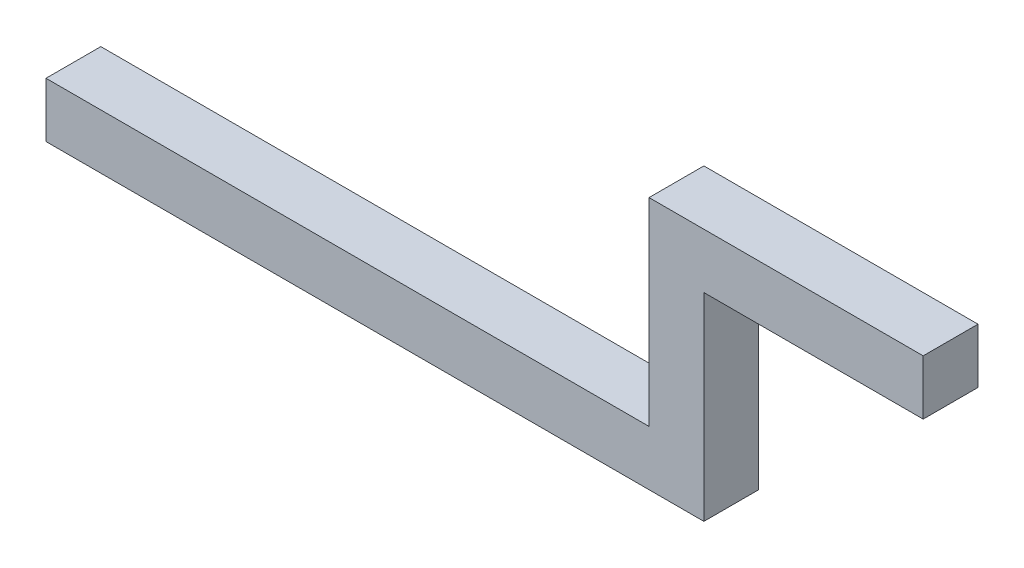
ISO-10303-21;
HEADER;
FILE_DESCRIPTION(('STEP AP214'),'2;1');
FILE_NAME('part.step','',(''),(''),'','','');
FILE_SCHEMA(('AUTOMOTIVE_DESIGN { 1 0 10303 214 1 1 1 1 }'));
ENDSEC;
DATA;
#1=APPLICATION_CONTEXT('core data for automotive mechanical design processes');
#2=APPLICATION_PROTOCOL_DEFINITION('international standard','automotive_design',2000,#1);
#3=PRODUCT_CONTEXT('',#1,'mechanical');
#4=PRODUCT('Part','Part','',(#3));
#5=PRODUCT_RELATED_PRODUCT_CATEGORY('part','',(#4));
#6=PRODUCT_DEFINITION_FORMATION('','',#4);
#7=PRODUCT_DEFINITION_CONTEXT('part definition',#1,'design');
#8=PRODUCT_DEFINITION('design','',#6,#7);
#9=PRODUCT_DEFINITION_SHAPE('','',#8);
#10=(LENGTH_UNIT() NAMED_UNIT(*) SI_UNIT(.MILLI.,.METRE.));
#11=(NAMED_UNIT(*) PLANE_ANGLE_UNIT() SI_UNIT($,.RADIAN.));
#12=(NAMED_UNIT(*) SI_UNIT($,.STERADIAN.) SOLID_ANGLE_UNIT());
#13=UNCERTAINTY_MEASURE_WITH_UNIT(LENGTH_MEASURE(1.E-05),#10,'distance_accuracy_value','');
#14=(GEOMETRIC_REPRESENTATION_CONTEXT(3) GLOBAL_UNCERTAINTY_ASSIGNED_CONTEXT((#13)) GLOBAL_UNIT_ASSIGNED_CONTEXT((#10,
#11,#12)) REPRESENTATION_CONTEXT('',''));
#15=CARTESIAN_POINT('',(0.,0.,0.));
#16=DIRECTION('',(0.,0.,1.));
#17=DIRECTION('',(1.,0.,0.));
#18=AXIS2_PLACEMENT_3D('',#15,#16,#17);
#19=CARTESIAN_POINT('',(6.35,23.2878282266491,6.35));
#20=DIRECTION('',(-1.,0.,0.));
#21=DIRECTION('',(0.,-1.,0.));
#22=AXIS2_PLACEMENT_3D('',#19,#20,#21);
#23=PLANE('',#22);
#24=DIRECTION('',(0.,1.,0.));
#25=VECTOR('',#24,1.);
#26=CARTESIAN_POINT('',(6.35,23.2878282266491,0.));
#27=LINE('',#26,#25);
#28=CARTESIAN_POINT('',(6.35,16.9378282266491,0.));
#29=VERTEX_POINT('',#28);
#30=CARTESIAN_POINT('',(6.35,39.8955292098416,0.));
#31=VERTEX_POINT('',#30);
#32=EDGE_CURVE('E93',#29,#31,#27,.T.);
#33=ORIENTED_EDGE('',*,*,#32,.T.);
#34=DIRECTION('',(0.,0.,-1.));
#35=VECTOR('',#34,1.);
#36=CARTESIAN_POINT('',(6.35,39.8955292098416,6.35));
#37=LINE('',#36,#35);
#38=CARTESIAN_POINT('',(6.35,39.8955292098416,6.35));
#39=VERTEX_POINT('',#38);
#40=EDGE_CURVE('E11',#39,#31,#37,.T.);
#41=ORIENTED_EDGE('',*,*,#40,.F.);
#42=DIRECTION('',(0.,1.,0.));
#43=VECTOR('',#42,1.);
#44=CARTESIAN_POINT('',(6.35,23.2878282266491,6.35));
#45=LINE('',#44,#43);
#46=CARTESIAN_POINT('',(6.35,16.9378282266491,6.35));
#47=VERTEX_POINT('',#46);
#48=EDGE_CURVE('E99',#47,#39,#45,.T.);
#49=ORIENTED_EDGE('',*,*,#48,.F.);
#50=DIRECTION('',(0.,0.,-1.));
#51=VECTOR('',#50,1.);
#52=CARTESIAN_POINT('',(6.35,16.9378282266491,6.35));
#53=LINE('',#52,#51);
#54=EDGE_CURVE('E137',#47,#29,#53,.T.);
#55=ORIENTED_EDGE('',*,*,#54,.T.);
#56=EDGE_LOOP('',(#33,#41,#49,#55));
#57=FACE_BOUND('',#56,.T.);
#58=ADVANCED_FACE('F38',(#57),#23,.F.);
#59=CARTESIAN_POINT('',(6.35,39.8955292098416,6.35));
#60=DIRECTION('',(0.,1.,0.));
#61=DIRECTION('',(0.,0.,1.));
#62=AXIS2_PLACEMENT_3D('',#59,#60,#61);
#63=PLANE('',#62);
#64=DIRECTION('',(1.,0.,0.));
#65=VECTOR('',#64,1.);
#66=CARTESIAN_POINT('',(6.35,39.8955292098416,0.));
#67=LINE('',#66,#65);
#68=CARTESIAN_POINT('',(31.75,39.8955292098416,0.));
#69=VERTEX_POINT('',#68);
#70=EDGE_CURVE('E143',#31,#69,#67,.T.);
#71=ORIENTED_EDGE('',*,*,#70,.T.);
#72=DIRECTION('',(0.,0.,-1.));
#73=VECTOR('',#72,1.);
#74=CARTESIAN_POINT('',(31.75,39.8955292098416,6.35));
#75=LINE('',#74,#73);
#76=CARTESIAN_POINT('',(31.75,39.8955292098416,6.35));
#77=VERTEX_POINT('',#76);
#78=EDGE_CURVE('E46',#77,#69,#75,.T.);
#79=ORIENTED_EDGE('',*,*,#78,.F.);
#80=DIRECTION('',(1.,0.,0.));
#81=VECTOR('',#80,1.);
#82=CARTESIAN_POINT('',(6.35,39.8955292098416,6.35));
#83=LINE('',#82,#81);
#84=EDGE_CURVE('E199',#39,#77,#83,.T.);
#85=ORIENTED_EDGE('',*,*,#84,.F.);
#86=ORIENTED_EDGE('',*,*,#40,.T.);
#87=EDGE_LOOP('',(#71,#79,#85,#86));
#88=FACE_BOUND('',#87,.T.);
#89=ADVANCED_FACE('F201',(#88),#63,.F.);
#90=CARTESIAN_POINT('',(31.75,39.8955292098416,6.35));
#91=DIRECTION('',(-1.,0.,0.));
#92=DIRECTION('',(0.,0.,1.));
#93=AXIS2_PLACEMENT_3D('',#90,#91,#92);
#94=PLANE('',#93);
#95=DIRECTION('',(0.,1.,0.));
#96=VECTOR('',#95,1.);
#97=CARTESIAN_POINT('',(31.75,39.8955292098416,0.));
#98=LINE('',#97,#96);
#99=CARTESIAN_POINT('',(31.75,46.2455292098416,0.));
#100=VERTEX_POINT('',#99);
#101=EDGE_CURVE('E146',#69,#100,#98,.T.);
#102=ORIENTED_EDGE('',*,*,#101,.T.);
#103=DIRECTION('',(0.,0.,-1.));
#104=VECTOR('',#103,1.);
#105=CARTESIAN_POINT('',(31.75,46.2455292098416,6.35));
#106=LINE('',#105,#104);
#107=CARTESIAN_POINT('',(31.75,46.2455292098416,6.35));
#108=VERTEX_POINT('',#107);
#109=EDGE_CURVE('E171',#108,#100,#106,.T.);
#110=ORIENTED_EDGE('',*,*,#109,.F.);
#111=DIRECTION('',(0.,1.,0.));
#112=VECTOR('',#111,1.);
#113=CARTESIAN_POINT('',(31.75,39.8955292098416,6.35));
#114=LINE('',#113,#112);
#115=EDGE_CURVE('E181',#77,#108,#114,.T.);
#116=ORIENTED_EDGE('',*,*,#115,.F.);
#117=ORIENTED_EDGE('',*,*,#78,.T.);
#118=EDGE_LOOP('',(#102,#110,#116,#117));
#119=FACE_BOUND('',#118,.T.);
#120=ADVANCED_FACE('F179',(#119),#94,.F.);
#121=CARTESIAN_POINT('',(0.,46.2455292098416,6.35));
#122=DIRECTION('',(0.,-1.,0.));
#123=DIRECTION('',(0.,0.,-1.));
#124=AXIS2_PLACEMENT_3D('',#121,#122,#123);
#125=PLANE('',#124);
#126=DIRECTION('',(-1.,0.,0.));
#127=VECTOR('',#126,1.);
#128=CARTESIAN_POINT('',(0.,46.2455292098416,0.));
#129=LINE('',#128,#127);
#130=CARTESIAN_POINT('',(0.,46.2455292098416,0.));
#131=VERTEX_POINT('',#130);
#132=EDGE_CURVE('E149',#100,#131,#129,.T.);
#133=ORIENTED_EDGE('',*,*,#132,.T.);
#134=DIRECTION('',(0.,0.,-1.));
#135=VECTOR('',#134,1.);
#136=CARTESIAN_POINT('',(0.,46.2455292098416,6.35));
#137=LINE('',#136,#135);
#138=CARTESIAN_POINT('',(0.,46.2455292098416,6.35));
#139=VERTEX_POINT('',#138);
#140=EDGE_CURVE('E167',#139,#131,#137,.T.);
#141=ORIENTED_EDGE('',*,*,#140,.F.);
#142=DIRECTION('',(-1.,0.,0.));
#143=VECTOR('',#142,1.);
#144=CARTESIAN_POINT('',(0.,46.2455292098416,6.35));
#145=LINE('',#144,#143);
#146=EDGE_CURVE('E194',#108,#139,#145,.T.);
#147=ORIENTED_EDGE('',*,*,#146,.F.);
#148=ORIENTED_EDGE('',*,*,#109,.T.);
#149=EDGE_LOOP('',(#133,#141,#147,#148));
#150=FACE_BOUND('',#149,.T.);
#151=ADVANCED_FACE('F189',(#150),#125,.F.);
#152=CARTESIAN_POINT('',(0.,23.2878282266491,6.35));
#153=DIRECTION('',(1.,0.,0.));
#154=DIRECTION('',(0.,0.,-1.));
#155=AXIS2_PLACEMENT_3D('',#152,#153,#154);
#156=PLANE('',#155);
#157=DIRECTION('',(0.,-1.,0.));
#158=VECTOR('',#157,1.);
#159=CARTESIAN_POINT('',(0.,23.2878282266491,0.));
#160=LINE('',#159,#158);
#161=CARTESIAN_POINT('',(0.,23.2878282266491,0.));
#162=VERTEX_POINT('',#161);
#163=EDGE_CURVE('E152',#131,#162,#160,.T.);
#164=ORIENTED_EDGE('',*,*,#163,.T.);
#165=DIRECTION('',(0.,0.,-1.));
#166=VECTOR('',#165,1.);
#167=CARTESIAN_POINT('',(0.,23.2878282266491,6.35));
#168=LINE('',#167,#166);
#169=CARTESIAN_POINT('',(0.,23.2878282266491,6.35));
#170=VERTEX_POINT('',#169);
#171=EDGE_CURVE('E131',#170,#162,#168,.T.);
#172=ORIENTED_EDGE('',*,*,#171,.F.);
#173=DIRECTION('',(0.,-1.,0.));
#174=VECTOR('',#173,1.);
#175=CARTESIAN_POINT('',(0.,23.2878282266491,6.35));
#176=LINE('',#175,#174);
#177=EDGE_CURVE('E120',#139,#170,#176,.T.);
#178=ORIENTED_EDGE('',*,*,#177,.F.);
#179=ORIENTED_EDGE('',*,*,#140,.T.);
#180=EDGE_LOOP('',(#164,#172,#178,#179));
#181=FACE_BOUND('',#180,.T.);
#182=ADVANCED_FACE('F192',(#181),#156,.F.);
#183=CARTESIAN_POINT('',(-69.85,23.2878282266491,6.35));
#184=DIRECTION('',(0.,-1.,0.));
#185=DIRECTION('',(1.,0.,0.));
#186=AXIS2_PLACEMENT_3D('',#183,#184,#185);
#187=PLANE('',#186);
#188=DIRECTION('',(-1.,0.,0.));
#189=VECTOR('',#188,1.);
#190=CARTESIAN_POINT('',(-69.85,23.2878282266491,0.));
#191=LINE('',#190,#189);
#192=CARTESIAN_POINT('',(-69.85,23.2878282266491,0.));
#193=VERTEX_POINT('',#192);
#194=EDGE_CURVE('E129',#162,#193,#191,.T.);
#195=ORIENTED_EDGE('',*,*,#194,.T.);
#196=DIRECTION('',(0.,0.,-1.));
#197=VECTOR('',#196,1.);
#198=CARTESIAN_POINT('',(-69.85,23.2878282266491,6.35));
#199=LINE('',#198,#197);
#200=CARTESIAN_POINT('',(-69.85,23.2878282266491,6.35));
#201=VERTEX_POINT('',#200);
#202=EDGE_CURVE('E126',#201,#193,#199,.T.);
#203=ORIENTED_EDGE('',*,*,#202,.F.);
#204=DIRECTION('',(-1.,0.,0.));
#205=VECTOR('',#204,1.);
#206=CARTESIAN_POINT('',(-69.85,23.2878282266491,6.35));
#207=LINE('',#206,#205);
#208=EDGE_CURVE('E114',#170,#201,#207,.T.);
#209=ORIENTED_EDGE('',*,*,#208,.F.);
#210=ORIENTED_EDGE('',*,*,#171,.T.);
#211=EDGE_LOOP('',(#195,#203,#209,#210));
#212=FACE_BOUND('',#211,.T.);
#213=ADVANCED_FACE('F127',(#212),#187,.F.);
#214=CARTESIAN_POINT('',(-69.85,23.2878282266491,6.35));
#215=DIRECTION('',(1.,0.,0.));
#216=DIRECTION('',(0.,0.,-1.));
#217=AXIS2_PLACEMENT_3D('',#214,#215,#216);
#218=PLANE('',#217);
#219=DIRECTION('',(0.,-1.,0.));
#220=VECTOR('',#219,1.);
#221=CARTESIAN_POINT('',(-69.85,23.2878282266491,0.));
#222=LINE('',#221,#220);
#223=CARTESIAN_POINT('',(-69.85,16.9378282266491,0.));
#224=VERTEX_POINT('',#223);
#225=EDGE_CURVE('E85',#193,#224,#222,.T.);
#226=ORIENTED_EDGE('',*,*,#225,.T.);
#227=DIRECTION('',(0.,0.,-1.));
#228=VECTOR('',#227,1.);
#229=CARTESIAN_POINT('',(-69.85,16.9378282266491,6.35));
#230=LINE('',#229,#228);
#231=CARTESIAN_POINT('',(-69.85,16.9378282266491,6.35));
#232=VERTEX_POINT('',#231);
#233=EDGE_CURVE('E132',#232,#224,#230,.T.);
#234=ORIENTED_EDGE('',*,*,#233,.F.);
#235=DIRECTION('',(0.,-1.,0.));
#236=VECTOR('',#235,1.);
#237=CARTESIAN_POINT('',(-69.85,23.2878282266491,6.35));
#238=LINE('',#237,#236);
#239=EDGE_CURVE('E118',#201,#232,#238,.T.);
#240=ORIENTED_EDGE('',*,*,#239,.F.);
#241=ORIENTED_EDGE('',*,*,#202,.T.);
#242=EDGE_LOOP('',(#226,#234,#240,#241));
#243=FACE_BOUND('',#242,.T.);
#244=ADVANCED_FACE('F134',(#243),#218,.F.);
#245=CARTESIAN_POINT('',(-69.85,16.9378282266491,6.35));
#246=DIRECTION('',(0.,1.,0.));
#247=DIRECTION('',(-1.,0.,0.));
#248=AXIS2_PLACEMENT_3D('',#245,#246,#247);
#249=PLANE('',#248);
#250=DIRECTION('',(1.,0.,0.));
#251=VECTOR('',#250,1.);
#252=CARTESIAN_POINT('',(-69.85,16.9378282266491,0.));
#253=LINE('',#252,#251);
#254=EDGE_CURVE('E159',#224,#29,#253,.T.);
#255=ORIENTED_EDGE('',*,*,#254,.T.);
#256=ORIENTED_EDGE('',*,*,#54,.F.);
#257=DIRECTION('',(1.,0.,0.));
#258=VECTOR('',#257,1.);
#259=CARTESIAN_POINT('',(-69.85,16.9378282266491,6.35));
#260=LINE('',#259,#258);
#261=EDGE_CURVE('E54',#232,#47,#260,.T.);
#262=ORIENTED_EDGE('',*,*,#261,.F.);
#263=ORIENTED_EDGE('',*,*,#233,.T.);
#264=EDGE_LOOP('',(#255,#256,#262,#263));
#265=FACE_BOUND('',#264,.T.);
#266=ADVANCED_FACE('F204',(#265),#249,.F.);
#267=CARTESIAN_POINT('',(6.34999999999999,16.9378282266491,6.35));
#268=DIRECTION('',(0.,0.,1.));
#269=DIRECTION('',(1.,0.,0.));
#270=AXIS2_PLACEMENT_3D('',#267,#268,#269);
#271=PLANE('',#270);
#272=ORIENTED_EDGE('',*,*,#48,.T.);
#273=ORIENTED_EDGE('',*,*,#84,.T.);
#274=ORIENTED_EDGE('',*,*,#115,.T.);
#275=ORIENTED_EDGE('',*,*,#146,.T.);
#276=ORIENTED_EDGE('',*,*,#177,.T.);
#277=ORIENTED_EDGE('',*,*,#208,.T.);
#278=ORIENTED_EDGE('',*,*,#239,.T.);
#279=ORIENTED_EDGE('',*,*,#261,.T.);
#280=EDGE_LOOP('',(#272,#273,#274,#275,#276,#277,#278,#279));
#281=FACE_BOUND('',#280,.T.);
#282=ADVANCED_FACE('F116',(#281),#271,.T.);
#283=CARTESIAN_POINT('',(6.34999999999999,16.9378282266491,0.));
#284=DIRECTION('',(0.,0.,1.));
#285=DIRECTION('',(1.,0.,0.));
#286=AXIS2_PLACEMENT_3D('',#283,#284,#285);
#287=PLANE('',#286);
#288=ORIENTED_EDGE('',*,*,#32,.F.);
#289=ORIENTED_EDGE('',*,*,#254,.F.);
#290=ORIENTED_EDGE('',*,*,#225,.F.);
#291=ORIENTED_EDGE('',*,*,#194,.F.);
#292=ORIENTED_EDGE('',*,*,#163,.F.);
#293=ORIENTED_EDGE('',*,*,#132,.F.);
#294=ORIENTED_EDGE('',*,*,#101,.F.);
#295=ORIENTED_EDGE('',*,*,#70,.F.);
#296=EDGE_LOOP('',(#288,#289,#290,#291,#292,#293,#294,#295));
#297=FACE_BOUND('',#296,.T.);
#298=ADVANCED_FACE('F185',(#297),#287,.F.);
#299=CLOSED_SHELL('',(#58,#89,#120,#151,#182,#213,#244,#266,#282,#298));
#300=MANIFOLD_SOLID_BREP('B2',#299);
#301=ADVANCED_BREP_SHAPE_REPRESENTATION('',(#18,#300),#14);
#302=SHAPE_DEFINITION_REPRESENTATION(#9,#301);
ENDSEC;
END-ISO-10303-21;
